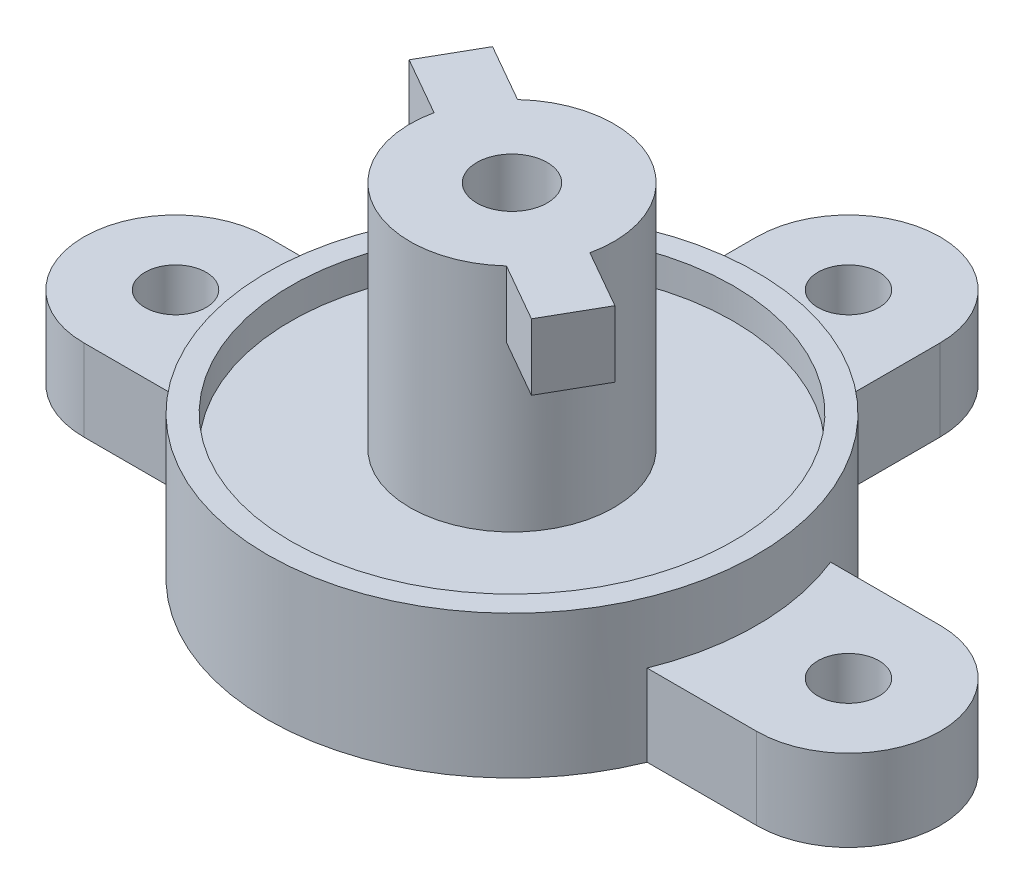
ISO-10303-21;
HEADER;
FILE_DESCRIPTION(('STEP AP214'),'2;1');
FILE_NAME('part.step','',(''),(''),'','','');
FILE_SCHEMA(('AUTOMOTIVE_DESIGN { 1 0 10303 214 1 1 1 1 }'));
ENDSEC;
DATA;
#1=APPLICATION_CONTEXT('core data for automotive mechanical design processes');
#2=APPLICATION_PROTOCOL_DEFINITION('international standard','automotive_design',2000,#1);
#3=PRODUCT_CONTEXT('',#1,'mechanical');
#4=PRODUCT('Part','Part','',(#3));
#5=PRODUCT_RELATED_PRODUCT_CATEGORY('part','',(#4));
#6=PRODUCT_DEFINITION_FORMATION('','',#4);
#7=PRODUCT_DEFINITION_CONTEXT('part definition',#1,'design');
#8=PRODUCT_DEFINITION('design','',#6,#7);
#9=PRODUCT_DEFINITION_SHAPE('','',#8);
#10=(LENGTH_UNIT() NAMED_UNIT(*) SI_UNIT(.MILLI.,.METRE.));
#11=(NAMED_UNIT(*) PLANE_ANGLE_UNIT() SI_UNIT($,.RADIAN.));
#12=(NAMED_UNIT(*) SI_UNIT($,.STERADIAN.) SOLID_ANGLE_UNIT());
#13=UNCERTAINTY_MEASURE_WITH_UNIT(LENGTH_MEASURE(1.E-05),#10,'distance_accuracy_value','');
#14=(GEOMETRIC_REPRESENTATION_CONTEXT(3) GLOBAL_UNCERTAINTY_ASSIGNED_CONTEXT((#13)) GLOBAL_UNIT_ASSIGNED_CONTEXT((#10,
#11,#12)) REPRESENTATION_CONTEXT('',''));
#15=CARTESIAN_POINT('',(0.,0.,0.));
#16=DIRECTION('',(0.,0.,1.));
#17=DIRECTION('',(1.,0.,0.));
#18=AXIS2_PLACEMENT_3D('',#15,#16,#17);
#19=CARTESIAN_POINT('',(68.25,-2.,-50.1242977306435));
#20=DIRECTION('',(0.,1.,0.));
#21=DIRECTION('',(0.,0.,1.));
#22=AXIS2_PLACEMENT_3D('',#19,#20,#21);
#23=PLANE('',#22);
#24=CARTESIAN_POINT('',(47.25,-2.,-39.));
#25=DIRECTION('',(0.,1.,0.));
#26=DIRECTION('',(0.,0.,1.));
#27=AXIS2_PLACEMENT_3D('',#24,#25,#26);
#28=CIRCLE('',#27,1.5);
#29=CARTESIAN_POINT('',(47.25,-2.,-37.5));
#30=VERTEX_POINT('',#29);
#31=EDGE_CURVE('E433',#30,#30,#28,.F.);
#32=ORIENTED_EDGE('',*,*,#31,.F.);
#33=EDGE_LOOP('',(#32));
#34=FACE_BOUND('',#33,.T.);
#35=CARTESIAN_POINT('',(80.25,-2.,-39.));
#36=DIRECTION('',(0.,1.,0.));
#37=DIRECTION('',(0.,0.,1.));
#38=AXIS2_PLACEMENT_3D('',#35,#36,#37);
#39=CIRCLE('',#38,1.50000000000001);
#40=CARTESIAN_POINT('',(80.25,-2.,-37.5));
#41=VERTEX_POINT('',#40);
#42=EDGE_CURVE('E103',#41,#41,#39,.T.);
#43=ORIENTED_EDGE('',*,*,#42,.T.);
#44=EDGE_LOOP('',(#43));
#45=FACE_BOUND('',#44,.T.);
#46=DIRECTION('',(1.,0.,0.));
#47=VECTOR('',#46,1.);
#48=CARTESIAN_POINT('',(0.,-2.,-43.5));
#49=LINE('',#48,#47);
#50=CARTESIAN_POINT('',(47.25,-2.,-43.5));
#51=VERTEX_POINT('',#50);
#52=CARTESIAN_POINT('',(52.6257022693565,-2.,-43.5));
#53=VERTEX_POINT('',#52);
#54=EDGE_CURVE('E107',#51,#53,#49,.T.);
#55=ORIENTED_EDGE('',*,*,#54,.T.);
#56=CARTESIAN_POINT('',(63.75,-2.,-39.));
#57=DIRECTION('',(0.,1.,0.));
#58=DIRECTION('',(0.,0.,1.));
#59=AXIS2_PLACEMENT_3D('',#56,#57,#58);
#60=CIRCLE('',#59,12.);
#61=CARTESIAN_POINT('',(59.25,-2.,-50.1242977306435));
#62=VERTEX_POINT('',#61);
#63=EDGE_CURVE('E145',#62,#53,#60,.T.);
#64=ORIENTED_EDGE('',*,*,#63,.F.);
#65=DIRECTION('',(0.,0.,1.));
#66=VECTOR('',#65,1.);
#67=CARTESIAN_POINT('',(59.25,-2.,0.));
#68=LINE('',#67,#66);
#69=CARTESIAN_POINT('',(59.25,-2.,-55.5));
#70=VERTEX_POINT('',#69);
#71=EDGE_CURVE('E50',#70,#62,#68,.T.);
#72=ORIENTED_EDGE('',*,*,#71,.F.);
#73=CARTESIAN_POINT('',(63.75,-2.,-55.5));
#74=DIRECTION('',(0.,1.,0.));
#75=DIRECTION('',(0.,0.,1.));
#76=AXIS2_PLACEMENT_3D('',#73,#74,#75);
#77=CIRCLE('',#76,4.49999999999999);
#78=CARTESIAN_POINT('',(68.25,-2.,-55.5));
#79=VERTEX_POINT('',#78);
#80=EDGE_CURVE('E11',#79,#70,#77,.T.);
#81=ORIENTED_EDGE('',*,*,#80,.F.);
#82=DIRECTION('',(0.,0.,1.));
#83=VECTOR('',#82,1.);
#84=CARTESIAN_POINT('',(68.25,-2.,0.));
#85=LINE('',#84,#83);
#86=CARTESIAN_POINT('',(68.25,-2.,-50.1242977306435));
#87=VERTEX_POINT('',#86);
#88=EDGE_CURVE('E44',#79,#87,#85,.T.);
#89=ORIENTED_EDGE('',*,*,#88,.T.);
#90=CARTESIAN_POINT('',(74.8742977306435,-2.,-43.5));
#91=VERTEX_POINT('',#90);
#92=EDGE_CURVE('E123',#91,#87,#60,.T.);
#93=ORIENTED_EDGE('',*,*,#92,.F.);
#94=DIRECTION('',(-1.,0.,0.));
#95=VECTOR('',#94,1.);
#96=CARTESIAN_POINT('',(0.,-2.,-43.5));
#97=LINE('',#96,#95);
#98=CARTESIAN_POINT('',(80.25,-2.,-43.5));
#99=VERTEX_POINT('',#98);
#100=EDGE_CURVE('E282',#99,#91,#97,.T.);
#101=ORIENTED_EDGE('',*,*,#100,.F.);
#102=CARTESIAN_POINT('',(80.25,-2.,-39.));
#103=DIRECTION('',(0.,1.,0.));
#104=DIRECTION('',(0.,0.,1.));
#105=AXIS2_PLACEMENT_3D('',#102,#103,#104);
#106=CIRCLE('',#105,4.49999999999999);
#107=CARTESIAN_POINT('',(80.25,-2.,-34.5));
#108=VERTEX_POINT('',#107);
#109=EDGE_CURVE('E88',#108,#99,#106,.T.);
#110=ORIENTED_EDGE('',*,*,#109,.F.);
#111=DIRECTION('',(-1.,0.,0.));
#112=VECTOR('',#111,1.);
#113=CARTESIAN_POINT('',(0.,-2.,-34.4999999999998));
#114=LINE('',#113,#112);
#115=CARTESIAN_POINT('',(74.8742977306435,-2.,-34.5));
#116=VERTEX_POINT('',#115);
#117=EDGE_CURVE('E109',#108,#116,#114,.T.);
#118=ORIENTED_EDGE('',*,*,#117,.T.);
#119=CARTESIAN_POINT('',(52.6257022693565,-2.,-34.5));
#120=VERTEX_POINT('',#119);
#121=EDGE_CURVE('E150',#120,#116,#60,.T.);
#122=ORIENTED_EDGE('',*,*,#121,.F.);
#123=DIRECTION('',(1.,0.,0.));
#124=VECTOR('',#123,1.);
#125=CARTESIAN_POINT('',(0.,-2.,-34.5));
#126=LINE('',#125,#124);
#127=CARTESIAN_POINT('',(47.25,-2.,-34.5));
#128=VERTEX_POINT('',#127);
#129=EDGE_CURVE('E251',#128,#120,#126,.T.);
#130=ORIENTED_EDGE('',*,*,#129,.F.);
#131=CARTESIAN_POINT('',(47.25,-2.,-39.));
#132=DIRECTION('',(0.,1.,0.));
#133=DIRECTION('',(0.,0.,1.));
#134=AXIS2_PLACEMENT_3D('',#131,#132,#133);
#135=CIRCLE('',#134,4.5);
#136=EDGE_CURVE('E254',#51,#128,#135,.T.);
#137=ORIENTED_EDGE('',*,*,#136,.F.);
#138=EDGE_LOOP('',(#55,#64,#72,#81,#89,#93,#101,#110,#118,#122,#130,#137));
#139=FACE_BOUND('',#138,.T.);
#140=CARTESIAN_POINT('',(63.75,-2.,-55.5));
#141=DIRECTION('',(0.,1.,0.));
#142=DIRECTION('',(0.,0.,1.));
#143=AXIS2_PLACEMENT_3D('',#140,#141,#142);
#144=CIRCLE('',#143,1.5);
#145=CARTESIAN_POINT('',(63.75,-2.,-54.));
#146=VERTEX_POINT('',#145);
#147=EDGE_CURVE('E432',#146,#146,#144,.F.);
#148=ORIENTED_EDGE('',*,*,#147,.F.);
#149=EDGE_LOOP('',(#148));
#150=FACE_BOUND('',#149,.T.);
#151=CARTESIAN_POINT('',(63.75,-2.,-39.));
#152=DIRECTION('',(0.,1.,0.));
#153=DIRECTION('',(0.,0.,1.));
#154=AXIS2_PLACEMENT_3D('',#151,#152,#153);
#155=CIRCLE('',#154,1.725);
#156=CARTESIAN_POINT('',(63.75,-2.,-37.275));
#157=VERTEX_POINT('',#156);
#158=EDGE_CURVE('E106',#157,#157,#155,.F.);
#159=ORIENTED_EDGE('',*,*,#158,.F.);
#160=EDGE_LOOP('',(#159));
#161=FACE_BOUND('',#160,.T.);
#162=ADVANCED_FACE('F41',(#34,#45,#139,#150,#161),#23,.F.);
#163=CARTESIAN_POINT('',(0.,11.55,0.));
#164=DIRECTION('',(0.,1.,0.));
#165=DIRECTION('',(0.,0.,1.));
#166=AXIS2_PLACEMENT_3D('',#163,#164,#165);
#167=PLANE('',#166);
#168=CARTESIAN_POINT('',(63.75,11.55,-39.));
#169=DIRECTION('',(0.,1.,0.));
#170=DIRECTION('',(0.,0.,1.));
#171=AXIS2_PLACEMENT_3D('',#168,#169,#170);
#172=CIRCLE('',#171,5.00000000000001);
#173=CARTESIAN_POINT('',(60.3529525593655,11.55,-42.6687966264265));
#174=VERTEX_POINT('',#173);
#175=CARTESIAN_POINT('',(58.864535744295,11.55,-40.0640672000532));
#176=VERTEX_POINT('',#175);
#177=EDGE_CURVE('E190',#174,#176,#172,.T.);
#178=ORIENTED_EDGE('',*,*,#177,.T.);
#179=DIRECTION('',(-0.868243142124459,0.,-0.496138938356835));
#180=VECTOR('',#179,1.);
#181=CARTESIAN_POINT('',(31.7480992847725,11.55,-55.5591737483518));
#182=LINE('',#181,#180);
#183=CARTESIAN_POINT('',(56.0057915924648,11.55,-41.6976352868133));
#184=VERTEX_POINT('',#183);
#185=EDGE_CURVE('E177',#176,#184,#182,.T.);
#186=ORIENTED_EDGE('',*,*,#185,.T.);
#187=DIRECTION('',(0.496138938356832,0.,-0.86824314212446));
#188=VECTOR('',#187,1.);
#189=CARTESIAN_POINT('',(24.2576923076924,11.55,13.8615384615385));
#190=LINE('',#189,#188);
#191=CARTESIAN_POINT('',(57.4942084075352,11.55,-44.3023647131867));
#192=VERTEX_POINT('',#191);
#193=EDGE_CURVE('E199',#184,#192,#190,.T.);
#194=ORIENTED_EDGE('',*,*,#193,.T.);
#195=DIRECTION('',(-0.86824314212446,0.,-0.496138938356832));
#196=VECTOR('',#195,1.);
#197=CARTESIAN_POINT('',(33.2365160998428,11.55,-58.1639031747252));
#198=LINE('',#197,#196);
#199=EDGE_CURVE('E202',#174,#192,#198,.T.);
#200=ORIENTED_EDGE('',*,*,#199,.F.);
#201=EDGE_LOOP('',(#178,#186,#194,#200));
#202=FACE_BOUND('',#201,.T.);
#203=ADVANCED_FACE('F324',(#202),#167,.F.);
#204=CARTESIAN_POINT('',(0.,11.55,0.));
#205=DIRECTION('',(0.,1.,0.));
#206=DIRECTION('',(0.,0.,1.));
#207=AXIS2_PLACEMENT_3D('',#204,#205,#206);
#208=PLANE('',#207);
#209=CARTESIAN_POINT('',(63.75,11.55,-39.));
#210=DIRECTION('',(0.,1.,0.));
#211=DIRECTION('',(0.,0.,1.));
#212=AXIS2_PLACEMENT_3D('',#209,#210,#211);
#213=CIRCLE('',#212,5.00000000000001);
#214=CARTESIAN_POINT('',(67.1470474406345,11.55,-35.3312033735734));
#215=VERTEX_POINT('',#214);
#216=CARTESIAN_POINT('',(68.635464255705,11.55,-37.9359327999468));
#217=VERTEX_POINT('',#216);
#218=EDGE_CURVE('E223',#215,#217,#213,.T.);
#219=ORIENTED_EDGE('',*,*,#218,.T.);
#220=DIRECTION('',(0.868243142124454,0.,0.496138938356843));
#221=VECTOR('',#220,1.);
#222=CARTESIAN_POINT('',(33.2365160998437,11.55,-58.1639031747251));
#223=LINE('',#222,#221);
#224=CARTESIAN_POINT('',(71.4942084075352,11.55,-36.3023647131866));
#225=VERTEX_POINT('',#224);
#226=EDGE_CURVE('E210',#217,#225,#223,.T.);
#227=ORIENTED_EDGE('',*,*,#226,.T.);
#228=DIRECTION('',(-0.496138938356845,0.,0.868243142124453));
#229=VECTOR('',#228,1.);
#230=CARTESIAN_POINT('',(38.2576923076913,11.55,21.8615384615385));
#231=LINE('',#230,#229);
#232=CARTESIAN_POINT('',(70.0057915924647,11.55,-33.6976352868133));
#233=VERTEX_POINT('',#232);
#234=EDGE_CURVE('E232',#225,#233,#231,.T.);
#235=ORIENTED_EDGE('',*,*,#234,.T.);
#236=DIRECTION('',(0.868243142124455,0.,0.496138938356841));
#237=VECTOR('',#236,1.);
#238=CARTESIAN_POINT('',(31.7480992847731,11.55,-55.5591737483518));
#239=LINE('',#238,#237);
#240=EDGE_CURVE('E235',#215,#233,#239,.T.);
#241=ORIENTED_EDGE('',*,*,#240,.F.);
#242=EDGE_LOOP('',(#219,#227,#235,#241));
#243=FACE_BOUND('',#242,.T.);
#244=ADVANCED_FACE('F330',(#243),#208,.F.);
#245=CARTESIAN_POINT('',(0.,3.5,0.));
#246=DIRECTION('',(0.,1.,0.));
#247=DIRECTION('',(0.,0.,1.));
#248=AXIS2_PLACEMENT_3D('',#245,#246,#247);
#249=PLANE('',#248);
#250=CARTESIAN_POINT('',(63.75,3.5,-39.));
#251=DIRECTION('',(0.,1.,0.));
#252=DIRECTION('',(0.,0.,1.));
#253=AXIS2_PLACEMENT_3D('',#250,#251,#252);
#254=CIRCLE('',#253,5.00000000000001);
#255=CARTESIAN_POINT('',(63.75,3.5,-34.));
#256=VERTEX_POINT('',#255);
#257=EDGE_CURVE('E164',#256,#256,#254,.T.);
#258=ORIENTED_EDGE('',*,*,#257,.F.);
#259=EDGE_LOOP('',(#258));
#260=FACE_BOUND('',#259,.T.);
#261=CARTESIAN_POINT('',(63.75,3.5,-39.));
#262=DIRECTION('',(0.,1.,0.));
#263=DIRECTION('',(0.,0.,1.));
#264=AXIS2_PLACEMENT_3D('',#261,#262,#263);
#265=CIRCLE('',#264,10.85);
#266=CARTESIAN_POINT('',(63.75,3.5,-28.15));
#267=VERTEX_POINT('',#266);
#268=EDGE_CURVE('E154',#267,#267,#265,.F.);
#269=ORIENTED_EDGE('',*,*,#268,.F.);
#270=EDGE_LOOP('',(#269));
#271=FACE_BOUND('',#270,.T.);
#272=ADVANCED_FACE('F350',(#260,#271),#249,.T.);
#273=CARTESIAN_POINT('',(63.75,5.,-39.));
#274=DIRECTION('',(0.,-1.,0.));
#275=DIRECTION('',(0.,0.,-1.));
#276=AXIS2_PLACEMENT_3D('',#273,#274,#275);
#277=CYLINDRICAL_SURFACE('',#276,10.85);
#278=CARTESIAN_POINT('',(63.75,5.,-39.));
#279=DIRECTION('',(0.,1.,0.));
#280=DIRECTION('',(0.,0.,1.));
#281=AXIS2_PLACEMENT_3D('',#278,#279,#280);
#282=CIRCLE('',#281,10.85);
#283=CARTESIAN_POINT('',(63.75,5.,-28.15));
#284=VERTEX_POINT('',#283);
#285=EDGE_CURVE('E160',#284,#284,#282,.T.);
#286=ORIENTED_EDGE('',*,*,#285,.T.);
#287=EDGE_LOOP('',(#286));
#288=FACE_BOUND('',#287,.T.);
#289=ORIENTED_EDGE('',*,*,#268,.T.);
#290=EDGE_LOOP('',(#289));
#291=FACE_BOUND('',#290,.T.);
#292=ADVANCED_FACE('F353',(#288,#291),#277,.F.);
#293=CARTESIAN_POINT('',(0.,5.,0.));
#294=DIRECTION('',(0.,1.,0.));
#295=DIRECTION('',(0.,0.,1.));
#296=AXIS2_PLACEMENT_3D('',#293,#294,#295);
#297=PLANE('',#296);
#298=ORIENTED_EDGE('',*,*,#285,.F.);
#299=EDGE_LOOP('',(#298));
#300=FACE_BOUND('',#299,.T.);
#301=CARTESIAN_POINT('',(63.75,5.,-39.));
#302=DIRECTION('',(0.,1.,0.));
#303=DIRECTION('',(0.,0.,1.));
#304=AXIS2_PLACEMENT_3D('',#301,#302,#303);
#305=CIRCLE('',#304,12.);
#306=CARTESIAN_POINT('',(63.75,5.,-27.));
#307=VERTEX_POINT('',#306);
#308=EDGE_CURVE('E153',#307,#307,#305,.T.);
#309=ORIENTED_EDGE('',*,*,#308,.T.);
#310=EDGE_LOOP('',(#309));
#311=FACE_BOUND('',#310,.T.);
#312=ADVANCED_FACE('F357',(#300,#311),#297,.T.);
#313=CARTESIAN_POINT('',(0.,2.,-43.5));
#314=DIRECTION('',(0.,0.,-1.));
#315=DIRECTION('',(-1.,0.,0.));
#316=AXIS2_PLACEMENT_3D('',#313,#314,#315);
#317=PLANE('',#316);
#318=ORIENTED_EDGE('',*,*,#54,.F.);
#319=DIRECTION('',(0.,-1.,0.));
#320=VECTOR('',#319,1.);
#321=CARTESIAN_POINT('',(47.25,2.,-43.5));
#322=LINE('',#321,#320);
#323=CARTESIAN_POINT('',(47.25,2.,-43.5));
#324=VERTEX_POINT('',#323);
#325=EDGE_CURVE('E229',#324,#51,#322,.T.);
#326=ORIENTED_EDGE('',*,*,#325,.F.);
#327=DIRECTION('',(1.,0.,0.));
#328=VECTOR('',#327,1.);
#329=CARTESIAN_POINT('',(0.,2.,-43.5));
#330=LINE('',#329,#328);
#331=CARTESIAN_POINT('',(52.6257022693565,2.,-43.5));
#332=VERTEX_POINT('',#331);
#333=EDGE_CURVE('E267',#324,#332,#330,.T.);
#334=ORIENTED_EDGE('',*,*,#333,.T.);
#335=DIRECTION('',(0.,-1.,0.));
#336=VECTOR('',#335,1.);
#337=CARTESIAN_POINT('',(52.6257022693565,2.,-43.5));
#338=LINE('',#337,#336);
#339=EDGE_CURVE('E248',#332,#53,#338,.T.);
#340=ORIENTED_EDGE('',*,*,#339,.T.);
#341=EDGE_LOOP('',(#318,#326,#334,#340));
#342=FACE_BOUND('',#341,.T.);
#343=ADVANCED_FACE('F361',(#342),#317,.T.);
#344=CARTESIAN_POINT('',(47.25,2.,-39.));
#345=DIRECTION('',(0.,-1.,0.));
#346=DIRECTION('',(0.,0.,-1.));
#347=AXIS2_PLACEMENT_3D('',#344,#345,#346);
#348=CYLINDRICAL_SURFACE('',#347,4.5);
#349=ORIENTED_EDGE('',*,*,#136,.T.);
#350=DIRECTION('',(0.,-1.,0.));
#351=VECTOR('',#350,1.);
#352=CARTESIAN_POINT('',(47.25,2.,-34.5));
#353=LINE('',#352,#351);
#354=CARTESIAN_POINT('',(47.25,2.,-34.5));
#355=VERTEX_POINT('',#354);
#356=EDGE_CURVE('E242',#355,#128,#353,.T.);
#357=ORIENTED_EDGE('',*,*,#356,.F.);
#358=CARTESIAN_POINT('',(47.25,2.,-39.));
#359=DIRECTION('',(0.,1.,0.));
#360=DIRECTION('',(0.,0.,1.));
#361=AXIS2_PLACEMENT_3D('',#358,#359,#360);
#362=CIRCLE('',#361,4.5);
#363=EDGE_CURVE('E264',#324,#355,#362,.T.);
#364=ORIENTED_EDGE('',*,*,#363,.F.);
#365=ORIENTED_EDGE('',*,*,#325,.T.);
#366=EDGE_LOOP('',(#349,#357,#364,#365));
#367=FACE_BOUND('',#366,.T.);
#368=ADVANCED_FACE('F394',(#367),#348,.T.);
#369=CARTESIAN_POINT('',(0.,2.,0.));
#370=DIRECTION('',(0.,1.,0.));
#371=DIRECTION('',(0.,0.,1.));
#372=AXIS2_PLACEMENT_3D('',#369,#370,#371);
#373=PLANE('',#372);
#374=CARTESIAN_POINT('',(47.25,2.,-39.));
#375=DIRECTION('',(0.,1.,0.));
#376=DIRECTION('',(0.,0.,1.));
#377=AXIS2_PLACEMENT_3D('',#374,#375,#376);
#378=CIRCLE('',#377,1.5);
#379=CARTESIAN_POINT('',(47.25,2.,-37.5));
#380=VERTEX_POINT('',#379);
#381=EDGE_CURVE('E255',#380,#380,#378,.F.);
#382=ORIENTED_EDGE('',*,*,#381,.T.);
#383=EDGE_LOOP('',(#382));
#384=FACE_BOUND('',#383,.T.);
#385=ORIENTED_EDGE('',*,*,#333,.F.);
#386=ORIENTED_EDGE('',*,*,#363,.T.);
#387=DIRECTION('',(1.,0.,0.));
#388=VECTOR('',#387,1.);
#389=CARTESIAN_POINT('',(0.,2.,-34.5));
#390=LINE('',#389,#388);
#391=CARTESIAN_POINT('',(52.6257022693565,2.,-34.5));
#392=VERTEX_POINT('',#391);
#393=EDGE_CURVE('E261',#355,#392,#390,.T.);
#394=ORIENTED_EDGE('',*,*,#393,.T.);
#395=CARTESIAN_POINT('',(63.75,2.,-39.));
#396=DIRECTION('',(0.,1.,0.));
#397=DIRECTION('',(0.,0.,1.));
#398=AXIS2_PLACEMENT_3D('',#395,#396,#397);
#399=CIRCLE('',#398,12.);
#400=EDGE_CURVE('E250',#392,#332,#399,.F.);
#401=ORIENTED_EDGE('',*,*,#400,.T.);
#402=EDGE_LOOP('',(#385,#386,#394,#401));
#403=FACE_BOUND('',#402,.T.);
#404=ADVANCED_FACE('F397',(#384,#403),#373,.T.);
#405=CARTESIAN_POINT('',(0.,2.,-34.4999999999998));
#406=DIRECTION('',(0.,0.,1.));
#407=DIRECTION('',(1.,0.,0.));
#408=AXIS2_PLACEMENT_3D('',#405,#406,#407);
#409=PLANE('',#408);
#410=ORIENTED_EDGE('',*,*,#117,.F.);
#411=DIRECTION('',(0.,-1.,0.));
#412=VECTOR('',#411,1.);
#413=CARTESIAN_POINT('',(80.25,2.,-34.5));
#414=LINE('',#413,#412);
#415=CARTESIAN_POINT('',(80.25,2.,-34.5));
#416=VERTEX_POINT('',#415);
#417=EDGE_CURVE('E258',#416,#108,#414,.T.);
#418=ORIENTED_EDGE('',*,*,#417,.F.);
#419=DIRECTION('',(-1.,0.,0.));
#420=VECTOR('',#419,1.);
#421=CARTESIAN_POINT('',(0.,2.,-34.4999999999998));
#422=LINE('',#421,#420);
#423=CARTESIAN_POINT('',(74.8742977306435,2.,-34.5));
#424=VERTEX_POINT('',#423);
#425=EDGE_CURVE('E296',#416,#424,#422,.T.);
#426=ORIENTED_EDGE('',*,*,#425,.T.);
#427=DIRECTION('',(0.,-1.,0.));
#428=VECTOR('',#427,1.);
#429=CARTESIAN_POINT('',(74.8742977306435,2.,-34.5));
#430=LINE('',#429,#428);
#431=EDGE_CURVE('E279',#424,#116,#430,.T.);
#432=ORIENTED_EDGE('',*,*,#431,.T.);
#433=EDGE_LOOP('',(#410,#418,#426,#432));
#434=FACE_BOUND('',#433,.T.);
#435=ADVANCED_FACE('F402',(#434),#409,.T.);
#436=CARTESIAN_POINT('',(80.25,2.,-39.));
#437=DIRECTION('',(0.,-1.,0.));
#438=DIRECTION('',(0.,0.,-1.));
#439=AXIS2_PLACEMENT_3D('',#436,#437,#438);
#440=CYLINDRICAL_SURFACE('',#439,4.49999999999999);
#441=ORIENTED_EDGE('',*,*,#109,.T.);
#442=DIRECTION('',(0.,-1.,0.));
#443=VECTOR('',#442,1.);
#444=CARTESIAN_POINT('',(80.25,2.,-43.5));
#445=LINE('',#444,#443);
#446=CARTESIAN_POINT('',(80.25,2.,-43.5));
#447=VERTEX_POINT('',#446);
#448=EDGE_CURVE('E274',#447,#99,#445,.T.);
#449=ORIENTED_EDGE('',*,*,#448,.F.);
#450=CARTESIAN_POINT('',(80.25,2.,-39.));
#451=DIRECTION('',(0.,1.,0.));
#452=DIRECTION('',(0.,0.,1.));
#453=AXIS2_PLACEMENT_3D('',#450,#451,#452);
#454=CIRCLE('',#453,4.49999999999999);
#455=EDGE_CURVE('E293',#416,#447,#454,.T.);
#456=ORIENTED_EDGE('',*,*,#455,.F.);
#457=ORIENTED_EDGE('',*,*,#417,.T.);
#458=EDGE_LOOP('',(#441,#449,#456,#457));
#459=FACE_BOUND('',#458,.T.);
#460=ADVANCED_FACE('F406',(#459),#440,.T.);
#461=CARTESIAN_POINT('',(0.,2.,0.));
#462=DIRECTION('',(0.,1.,0.));
#463=DIRECTION('',(0.,0.,1.));
#464=AXIS2_PLACEMENT_3D('',#461,#462,#463);
#465=PLANE('',#464);
#466=CARTESIAN_POINT('',(80.25,2.,-39.));
#467=DIRECTION('',(0.,1.,0.));
#468=DIRECTION('',(0.,0.,1.));
#469=AXIS2_PLACEMENT_3D('',#466,#467,#468);
#470=CIRCLE('',#469,1.50000000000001);
#471=CARTESIAN_POINT('',(80.25,2.,-37.5));
#472=VERTEX_POINT('',#471);
#473=EDGE_CURVE('E285',#472,#472,#470,.F.);
#474=ORIENTED_EDGE('',*,*,#473,.T.);
#475=EDGE_LOOP('',(#474));
#476=FACE_BOUND('',#475,.T.);
#477=ORIENTED_EDGE('',*,*,#425,.F.);
#478=ORIENTED_EDGE('',*,*,#455,.T.);
#479=DIRECTION('',(-1.,0.,0.));
#480=VECTOR('',#479,1.);
#481=CARTESIAN_POINT('',(0.,2.,-43.5));
#482=LINE('',#481,#480);
#483=CARTESIAN_POINT('',(74.8742977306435,2.,-43.5));
#484=VERTEX_POINT('',#483);
#485=EDGE_CURVE('E290',#447,#484,#482,.T.);
#486=ORIENTED_EDGE('',*,*,#485,.T.);
#487=CARTESIAN_POINT('',(63.75,2.,-39.));
#488=DIRECTION('',(0.,1.,0.));
#489=DIRECTION('',(0.,0.,1.));
#490=AXIS2_PLACEMENT_3D('',#487,#488,#489);
#491=CIRCLE('',#490,12.);
#492=EDGE_CURVE('E281',#484,#424,#491,.F.);
#493=ORIENTED_EDGE('',*,*,#492,.T.);
#494=EDGE_LOOP('',(#477,#478,#486,#493));
#495=FACE_BOUND('',#494,.T.);
#496=ADVANCED_FACE('F302',(#476,#495),#465,.T.);
#497=CARTESIAN_POINT('',(68.25,2.,0.));
#498=DIRECTION('',(1.,0.,0.));
#499=DIRECTION('',(0.,0.,-1.));
#500=AXIS2_PLACEMENT_3D('',#497,#498,#499);
#501=PLANE('',#500);
#502=ORIENTED_EDGE('',*,*,#88,.F.);
#503=DIRECTION('',(0.,-1.,0.));
#504=VECTOR('',#503,1.);
#505=CARTESIAN_POINT('',(68.25,2.,-55.5));
#506=LINE('',#505,#504);
#507=CARTESIAN_POINT('',(68.25,2.,-55.5));
#508=VERTEX_POINT('',#507);
#509=EDGE_CURVE('E78',#508,#79,#506,.T.);
#510=ORIENTED_EDGE('',*,*,#509,.F.);
#511=DIRECTION('',(0.,0.,1.));
#512=VECTOR('',#511,1.);
#513=CARTESIAN_POINT('',(68.25,2.,0.));
#514=LINE('',#513,#512);
#515=CARTESIAN_POINT('',(68.25,2.,-50.1242977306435));
#516=VERTEX_POINT('',#515);
#517=EDGE_CURVE('E83',#508,#516,#514,.T.);
#518=ORIENTED_EDGE('',*,*,#517,.T.);
#519=DIRECTION('',(0.,-1.,0.));
#520=VECTOR('',#519,1.);
#521=CARTESIAN_POINT('',(68.25,2.,-50.1242977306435));
#522=LINE('',#521,#520);
#523=EDGE_CURVE('E127',#516,#87,#522,.T.);
#524=ORIENTED_EDGE('',*,*,#523,.T.);
#525=EDGE_LOOP('',(#502,#510,#518,#524));
#526=FACE_BOUND('',#525,.T.);
#527=ADVANCED_FACE('F80',(#526),#501,.T.);
#528=CARTESIAN_POINT('',(63.75,2.,-55.5));
#529=DIRECTION('',(0.,-1.,0.));
#530=DIRECTION('',(0.,0.,-1.));
#531=AXIS2_PLACEMENT_3D('',#528,#529,#530);
#532=CYLINDRICAL_SURFACE('',#531,4.49999999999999);
#533=ORIENTED_EDGE('',*,*,#80,.T.);
#534=DIRECTION('',(0.,-1.,0.));
#535=VECTOR('',#534,1.);
#536=CARTESIAN_POINT('',(59.25,2.,-55.5));
#537=LINE('',#536,#535);
#538=CARTESIAN_POINT('',(59.25,2.,-55.5));
#539=VERTEX_POINT('',#538);
#540=EDGE_CURVE('E87',#539,#70,#537,.T.);
#541=ORIENTED_EDGE('',*,*,#540,.F.);
#542=CARTESIAN_POINT('',(63.75,2.,-55.5));
#543=DIRECTION('',(0.,1.,0.));
#544=DIRECTION('',(0.,0.,1.));
#545=AXIS2_PLACEMENT_3D('',#542,#543,#544);
#546=CIRCLE('',#545,4.49999999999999);
#547=EDGE_CURVE('E90',#508,#539,#546,.T.);
#548=ORIENTED_EDGE('',*,*,#547,.F.);
#549=ORIENTED_EDGE('',*,*,#509,.T.);
#550=EDGE_LOOP('',(#533,#541,#548,#549));
#551=FACE_BOUND('',#550,.T.);
#552=ADVANCED_FACE('F91',(#551),#532,.T.);
#553=CARTESIAN_POINT('',(0.,2.,0.));
#554=DIRECTION('',(0.,1.,0.));
#555=DIRECTION('',(0.,0.,1.));
#556=AXIS2_PLACEMENT_3D('',#553,#554,#555);
#557=PLANE('',#556);
#558=CARTESIAN_POINT('',(63.75,2.,-55.5));
#559=DIRECTION('',(0.,1.,0.));
#560=DIRECTION('',(0.,0.,1.));
#561=AXIS2_PLACEMENT_3D('',#558,#559,#560);
#562=CIRCLE('',#561,1.5);
#563=CARTESIAN_POINT('',(63.75,2.,-54.));
#564=VERTEX_POINT('',#563);
#565=EDGE_CURVE('E97',#564,#564,#562,.T.);
#566=ORIENTED_EDGE('',*,*,#565,.F.);
#567=EDGE_LOOP('',(#566));
#568=FACE_BOUND('',#567,.T.);
#569=ORIENTED_EDGE('',*,*,#517,.F.);
#570=ORIENTED_EDGE('',*,*,#547,.T.);
#571=DIRECTION('',(0.,0.,1.));
#572=VECTOR('',#571,1.);
#573=CARTESIAN_POINT('',(59.25,2.,0.));
#574=LINE('',#573,#572);
#575=CARTESIAN_POINT('',(59.25,2.,-50.1242977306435));
#576=VERTEX_POINT('',#575);
#577=EDGE_CURVE('E72',#539,#576,#574,.T.);
#578=ORIENTED_EDGE('',*,*,#577,.T.);
#579=CARTESIAN_POINT('',(63.75,2.,-39.));
#580=DIRECTION('',(0.,1.,0.));
#581=DIRECTION('',(0.,0.,1.));
#582=AXIS2_PLACEMENT_3D('',#579,#580,#581);
#583=CIRCLE('',#582,12.);
#584=EDGE_CURVE('E96',#576,#516,#583,.F.);
#585=ORIENTED_EDGE('',*,*,#584,.T.);
#586=EDGE_LOOP('',(#569,#570,#578,#585));
#587=FACE_BOUND('',#586,.T.);
#588=ADVANCED_FACE('F94',(#568,#587),#557,.T.);
#589=CARTESIAN_POINT('',(63.75,2.,-55.5));
#590=DIRECTION('',(0.,-1.,0.));
#591=DIRECTION('',(0.,0.,-1.));
#592=AXIS2_PLACEMENT_3D('',#589,#590,#591);
#593=CYLINDRICAL_SURFACE('',#592,1.5);
#594=ORIENTED_EDGE('',*,*,#565,.T.);
#595=EDGE_LOOP('',(#594));
#596=FACE_BOUND('',#595,.T.);
#597=ORIENTED_EDGE('',*,*,#147,.T.);
#598=EDGE_LOOP('',(#597));
#599=FACE_BOUND('',#598,.T.);
#600=ADVANCED_FACE('F349',(#596,#599),#593,.F.);
#601=CARTESIAN_POINT('',(63.75,3.5,-39.));
#602=DIRECTION('',(0.,-1.,0.));
#603=DIRECTION('',(0.,0.,-1.));
#604=AXIS2_PLACEMENT_3D('',#601,#602,#603);
#605=CYLINDRICAL_SURFACE('',#604,12.);
#606=ORIENTED_EDGE('',*,*,#92,.T.);
#607=ORIENTED_EDGE('',*,*,#523,.F.);
#608=ORIENTED_EDGE('',*,*,#584,.F.);
#609=DIRECTION('',(0.,-1.,0.));
#610=VECTOR('',#609,1.);
#611=CARTESIAN_POINT('',(59.25,2.,-50.1242977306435));
#612=LINE('',#611,#610);
#613=EDGE_CURVE('E129',#576,#62,#612,.T.);
#614=ORIENTED_EDGE('',*,*,#613,.T.);
#615=ORIENTED_EDGE('',*,*,#63,.T.);
#616=ORIENTED_EDGE('',*,*,#339,.F.);
#617=ORIENTED_EDGE('',*,*,#400,.F.);
#618=DIRECTION('',(0.,-1.,0.));
#619=VECTOR('',#618,1.);
#620=CARTESIAN_POINT('',(52.6257022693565,2.,-34.5));
#621=LINE('',#620,#619);
#622=EDGE_CURVE('E245',#392,#120,#621,.T.);
#623=ORIENTED_EDGE('',*,*,#622,.T.);
#624=ORIENTED_EDGE('',*,*,#121,.T.);
#625=ORIENTED_EDGE('',*,*,#431,.F.);
#626=ORIENTED_EDGE('',*,*,#492,.F.);
#627=DIRECTION('',(0.,-1.,0.));
#628=VECTOR('',#627,1.);
#629=CARTESIAN_POINT('',(74.8742977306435,2.,-43.5));
#630=LINE('',#629,#628);
#631=EDGE_CURVE('E277',#484,#91,#630,.T.);
#632=ORIENTED_EDGE('',*,*,#631,.T.);
#633=EDGE_LOOP('',(#606,#607,#608,#614,#615,#616,#617,#623,#624,#625,#626,#632));
#634=FACE_BOUND('',#633,.T.);
#635=ORIENTED_EDGE('',*,*,#308,.F.);
#636=EDGE_LOOP('',(#635));
#637=FACE_BOUND('',#636,.T.);
#638=ADVANCED_FACE('F140',(#634,#637),#605,.T.);
#639=CARTESIAN_POINT('',(59.25,2.,0.));
#640=DIRECTION('',(1.,0.,0.));
#641=DIRECTION('',(0.,0.,-1.));
#642=AXIS2_PLACEMENT_3D('',#639,#640,#641);
#643=PLANE('',#642);
#644=ORIENTED_EDGE('',*,*,#71,.T.);
#645=ORIENTED_EDGE('',*,*,#613,.F.);
#646=ORIENTED_EDGE('',*,*,#577,.F.);
#647=ORIENTED_EDGE('',*,*,#540,.T.);
#648=EDGE_LOOP('',(#644,#645,#646,#647));
#649=FACE_BOUND('',#648,.T.);
#650=ADVANCED_FACE('F146',(#649),#643,.F.);
#651=CARTESIAN_POINT('',(0.,2.,-43.5));
#652=DIRECTION('',(0.,0.,1.));
#653=DIRECTION('',(1.,0.,0.));
#654=AXIS2_PLACEMENT_3D('',#651,#652,#653);
#655=PLANE('',#654);
#656=ORIENTED_EDGE('',*,*,#100,.T.);
#657=ORIENTED_EDGE('',*,*,#631,.F.);
#658=ORIENTED_EDGE('',*,*,#485,.F.);
#659=ORIENTED_EDGE('',*,*,#448,.T.);
#660=EDGE_LOOP('',(#656,#657,#658,#659));
#661=FACE_BOUND('',#660,.T.);
#662=ADVANCED_FACE('F318',(#661),#655,.F.);
#663=CARTESIAN_POINT('',(0.,2.,-34.5));
#664=DIRECTION('',(0.,0.,-1.));
#665=DIRECTION('',(-1.,0.,0.));
#666=AXIS2_PLACEMENT_3D('',#663,#664,#665);
#667=PLANE('',#666);
#668=ORIENTED_EDGE('',*,*,#129,.T.);
#669=ORIENTED_EDGE('',*,*,#622,.F.);
#670=ORIENTED_EDGE('',*,*,#393,.F.);
#671=ORIENTED_EDGE('',*,*,#356,.T.);
#672=EDGE_LOOP('',(#668,#669,#670,#671));
#673=FACE_BOUND('',#672,.T.);
#674=ADVANCED_FACE('F308',(#673),#667,.F.);
#675=CARTESIAN_POINT('',(80.25,-7.,-39.));
#676=DIRECTION('',(0.,1.,0.));
#677=DIRECTION('',(0.,0.,1.));
#678=AXIS2_PLACEMENT_3D('',#675,#676,#677);
#679=CYLINDRICAL_SURFACE('',#678,1.50000000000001);
#680=ORIENTED_EDGE('',*,*,#42,.F.);
#681=EDGE_LOOP('',(#680));
#682=FACE_BOUND('',#681,.T.);
#683=ORIENTED_EDGE('',*,*,#473,.F.);
#684=EDGE_LOOP('',(#683));
#685=FACE_BOUND('',#684,.T.);
#686=ADVANCED_FACE('F305',(#682,#685),#679,.F.);
#687=CARTESIAN_POINT('',(47.25,-7.,-39.));
#688=DIRECTION('',(0.,1.,0.));
#689=DIRECTION('',(0.,0.,1.));
#690=AXIS2_PLACEMENT_3D('',#687,#688,#689);
#691=CYLINDRICAL_SURFACE('',#690,1.5);
#692=ORIENTED_EDGE('',*,*,#31,.T.);
#693=EDGE_LOOP('',(#692));
#694=FACE_BOUND('',#693,.T.);
#695=ORIENTED_EDGE('',*,*,#381,.F.);
#696=EDGE_LOOP('',(#695));
#697=FACE_BOUND('',#696,.T.);
#698=ADVANCED_FACE('F307',(#694,#697),#691,.F.);
#699=CARTESIAN_POINT('',(31.7480992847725,11.55,-55.5591737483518));
#700=DIRECTION('',(0.496138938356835,0.,-0.868243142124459));
#701=DIRECTION('',(-0.868243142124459,0.,-0.496138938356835));
#702=AXIS2_PLACEMENT_3D('',#699,#700,#701);
#703=PLANE('',#702);
#704=DIRECTION('',(-0.868243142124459,0.,-0.496138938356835));
#705=VECTOR('',#704,1.);
#706=CARTESIAN_POINT('',(31.7480992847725,14.8,-55.5591737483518));
#707=LINE('',#706,#705);
#708=CARTESIAN_POINT('',(58.864535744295,14.8,-40.0640672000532));
#709=VERTEX_POINT('',#708);
#710=CARTESIAN_POINT('',(56.0057915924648,14.8,-41.6976352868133));
#711=VERTEX_POINT('',#710);
#712=EDGE_CURVE('E186',#709,#711,#707,.T.);
#713=ORIENTED_EDGE('',*,*,#712,.T.);
#714=DIRECTION('',(0.,1.,0.));
#715=VECTOR('',#714,1.);
#716=CARTESIAN_POINT('',(56.0057915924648,11.55,-41.6976352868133));
#717=LINE('',#716,#715);
#718=EDGE_CURVE('E181',#184,#711,#717,.T.);
#719=ORIENTED_EDGE('',*,*,#718,.F.);
#720=ORIENTED_EDGE('',*,*,#185,.F.);
#721=DIRECTION('',(0.,1.,0.));
#722=VECTOR('',#721,1.);
#723=CARTESIAN_POINT('',(58.864535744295,11.55,-40.0640672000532));
#724=LINE('',#723,#722);
#725=EDGE_CURVE('E167',#176,#709,#724,.T.);
#726=ORIENTED_EDGE('',*,*,#725,.T.);
#727=EDGE_LOOP('',(#713,#719,#720,#726));
#728=FACE_BOUND('',#727,.T.);
#729=ADVANCED_FACE('F315',(#728),#703,.F.);
#730=CARTESIAN_POINT('',(24.2576923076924,11.55,13.8615384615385));
#731=DIRECTION('',(0.86824314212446,0.,0.496138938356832));
#732=DIRECTION('',(0.496138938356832,0.,-0.86824314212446));
#733=AXIS2_PLACEMENT_3D('',#730,#731,#732);
#734=PLANE('',#733);
#735=DIRECTION('',(0.496138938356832,0.,-0.86824314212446));
#736=VECTOR('',#735,1.);
#737=CARTESIAN_POINT('',(24.2576923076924,14.8,13.8615384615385));
#738=LINE('',#737,#736);
#739=CARTESIAN_POINT('',(57.4942084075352,14.8,-44.3023647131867));
#740=VERTEX_POINT('',#739);
#741=EDGE_CURVE('E189',#711,#740,#738,.T.);
#742=ORIENTED_EDGE('',*,*,#741,.T.);
#743=DIRECTION('',(0.,1.,0.));
#744=VECTOR('',#743,1.);
#745=CARTESIAN_POINT('',(57.4942084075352,11.55,-44.3023647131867));
#746=LINE('',#745,#744);
#747=EDGE_CURVE('E178',#192,#740,#746,.T.);
#748=ORIENTED_EDGE('',*,*,#747,.F.);
#749=ORIENTED_EDGE('',*,*,#193,.F.);
#750=ORIENTED_EDGE('',*,*,#718,.T.);
#751=EDGE_LOOP('',(#742,#748,#749,#750));
#752=FACE_BOUND('',#751,.T.);
#753=ADVANCED_FACE('F371',(#752),#734,.F.);
#754=CARTESIAN_POINT('',(33.2365160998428,11.55,-58.1639031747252));
#755=DIRECTION('',(0.496138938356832,0.,-0.86824314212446));
#756=DIRECTION('',(-0.86824314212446,0.,-0.496138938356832));
#757=AXIS2_PLACEMENT_3D('',#754,#755,#756);
#758=PLANE('',#757);
#759=DIRECTION('',(-0.86824314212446,0.,-0.496138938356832));
#760=VECTOR('',#759,1.);
#761=CARTESIAN_POINT('',(33.2365160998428,14.8,-58.1639031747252));
#762=LINE('',#761,#760);
#763=CARTESIAN_POINT('',(60.3529525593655,14.8,-42.6687966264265));
#764=VERTEX_POINT('',#763);
#765=EDGE_CURVE('E193',#764,#740,#762,.T.);
#766=ORIENTED_EDGE('',*,*,#765,.F.);
#767=DIRECTION('',(0.,1.,0.));
#768=VECTOR('',#767,1.);
#769=CARTESIAN_POINT('',(60.3529525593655,11.55,-42.6687966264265));
#770=LINE('',#769,#768);
#771=EDGE_CURVE('E174',#174,#764,#770,.T.);
#772=ORIENTED_EDGE('',*,*,#771,.F.);
#773=ORIENTED_EDGE('',*,*,#199,.T.);
#774=ORIENTED_EDGE('',*,*,#747,.T.);
#775=EDGE_LOOP('',(#766,#772,#773,#774));
#776=FACE_BOUND('',#775,.T.);
#777=ADVANCED_FACE('F367',(#776),#758,.T.);
#778=CARTESIAN_POINT('',(33.2365160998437,11.55,-58.1639031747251));
#779=DIRECTION('',(-0.496138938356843,0.,0.868243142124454));
#780=DIRECTION('',(0.868243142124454,0.,0.496138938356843));
#781=AXIS2_PLACEMENT_3D('',#778,#779,#780);
#782=PLANE('',#781);
#783=DIRECTION('',(0.868243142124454,0.,0.496138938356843));
#784=VECTOR('',#783,1.);
#785=CARTESIAN_POINT('',(33.2365160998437,14.8,-58.1639031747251));
#786=LINE('',#785,#784);
#787=CARTESIAN_POINT('',(68.635464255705,14.8,-37.9359327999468));
#788=VERTEX_POINT('',#787);
#789=CARTESIAN_POINT('',(71.4942084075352,14.8,-36.3023647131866));
#790=VERTEX_POINT('',#789);
#791=EDGE_CURVE('E219',#788,#790,#786,.T.);
#792=ORIENTED_EDGE('',*,*,#791,.T.);
#793=DIRECTION('',(0.,1.,0.));
#794=VECTOR('',#793,1.);
#795=CARTESIAN_POINT('',(71.4942084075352,11.55,-36.3023647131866));
#796=LINE('',#795,#794);
#797=EDGE_CURVE('E214',#225,#790,#796,.T.);
#798=ORIENTED_EDGE('',*,*,#797,.F.);
#799=ORIENTED_EDGE('',*,*,#226,.F.);
#800=DIRECTION('',(0.,1.,0.));
#801=VECTOR('',#800,1.);
#802=CARTESIAN_POINT('',(68.635464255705,11.55,-37.9359327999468));
#803=LINE('',#802,#801);
#804=EDGE_CURVE('E196',#217,#788,#803,.T.);
#805=ORIENTED_EDGE('',*,*,#804,.T.);
#806=EDGE_LOOP('',(#792,#798,#799,#805));
#807=FACE_BOUND('',#806,.T.);
#808=ADVANCED_FACE('F370',(#807),#782,.F.);
#809=CARTESIAN_POINT('',(38.2576923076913,11.55,21.8615384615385));
#810=DIRECTION('',(-0.868243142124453,0.,-0.496138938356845));
#811=DIRECTION('',(-0.496138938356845,0.,0.868243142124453));
#812=AXIS2_PLACEMENT_3D('',#809,#810,#811);
#813=PLANE('',#812);
#814=DIRECTION('',(-0.496138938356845,0.,0.868243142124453));
#815=VECTOR('',#814,1.);
#816=CARTESIAN_POINT('',(38.2576923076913,14.8,21.8615384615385));
#817=LINE('',#816,#815);
#818=CARTESIAN_POINT('',(70.0057915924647,14.8,-33.6976352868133));
#819=VERTEX_POINT('',#818);
#820=EDGE_CURVE('E222',#790,#819,#817,.T.);
#821=ORIENTED_EDGE('',*,*,#820,.T.);
#822=DIRECTION('',(0.,1.,0.));
#823=VECTOR('',#822,1.);
#824=CARTESIAN_POINT('',(70.0057915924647,11.55,-33.6976352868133));
#825=LINE('',#824,#823);
#826=EDGE_CURVE('E211',#233,#819,#825,.T.);
#827=ORIENTED_EDGE('',*,*,#826,.F.);
#828=ORIENTED_EDGE('',*,*,#234,.F.);
#829=ORIENTED_EDGE('',*,*,#797,.T.);
#830=EDGE_LOOP('',(#821,#827,#828,#829));
#831=FACE_BOUND('',#830,.T.);
#832=ADVANCED_FACE('F381',(#831),#813,.F.);
#833=CARTESIAN_POINT('',(31.7480992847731,11.55,-55.5591737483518));
#834=DIRECTION('',(-0.496138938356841,0.,0.868243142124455));
#835=DIRECTION('',(0.868243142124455,0.,0.496138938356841));
#836=AXIS2_PLACEMENT_3D('',#833,#834,#835);
#837=PLANE('',#836);
#838=DIRECTION('',(0.868243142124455,0.,0.496138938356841));
#839=VECTOR('',#838,1.);
#840=CARTESIAN_POINT('',(31.7480992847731,14.8,-55.5591737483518));
#841=LINE('',#840,#839);
#842=CARTESIAN_POINT('',(67.1470474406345,14.8,-35.3312033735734));
#843=VERTEX_POINT('',#842);
#844=EDGE_CURVE('E226',#843,#819,#841,.T.);
#845=ORIENTED_EDGE('',*,*,#844,.F.);
#846=DIRECTION('',(0.,1.,0.));
#847=VECTOR('',#846,1.);
#848=CARTESIAN_POINT('',(67.1470474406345,11.55,-35.3312033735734));
#849=LINE('',#848,#847);
#850=EDGE_CURVE('E207',#215,#843,#849,.T.);
#851=ORIENTED_EDGE('',*,*,#850,.F.);
#852=ORIENTED_EDGE('',*,*,#240,.T.);
#853=ORIENTED_EDGE('',*,*,#826,.T.);
#854=EDGE_LOOP('',(#845,#851,#852,#853));
#855=FACE_BOUND('',#854,.T.);
#856=ADVANCED_FACE('F364',(#855),#837,.T.);
#857=CARTESIAN_POINT('',(63.75,14.8,-39.));
#858=DIRECTION('',(0.,-1.,0.));
#859=DIRECTION('',(0.,0.,-1.));
#860=AXIS2_PLACEMENT_3D('',#857,#858,#859);
#861=CYLINDRICAL_SURFACE('',#860,5.00000000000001);
#862=ORIENTED_EDGE('',*,*,#257,.T.);
#863=EDGE_LOOP('',(#862));
#864=FACE_BOUND('',#863,.T.);
#865=ORIENTED_EDGE('',*,*,#804,.F.);
#866=ORIENTED_EDGE('',*,*,#218,.F.);
#867=ORIENTED_EDGE('',*,*,#850,.T.);
#868=CARTESIAN_POINT('',(63.75,14.8,-39.));
#869=DIRECTION('',(0.,1.,0.));
#870=DIRECTION('',(0.,0.,1.));
#871=AXIS2_PLACEMENT_3D('',#868,#869,#870);
#872=CIRCLE('',#871,5.00000000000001);
#873=EDGE_CURVE('E163',#709,#843,#872,.T.);
#874=ORIENTED_EDGE('',*,*,#873,.F.);
#875=ORIENTED_EDGE('',*,*,#725,.F.);
#876=ORIENTED_EDGE('',*,*,#177,.F.);
#877=ORIENTED_EDGE('',*,*,#771,.T.);
#878=EDGE_CURVE('E171',#788,#764,#872,.T.);
#879=ORIENTED_EDGE('',*,*,#878,.F.);
#880=EDGE_LOOP('',(#865,#866,#867,#874,#875,#876,#877,#879));
#881=FACE_BOUND('',#880,.T.);
#882=ADVANCED_FACE('F341',(#864,#881),#861,.T.);
#883=CARTESIAN_POINT('',(0.,14.8,0.));
#884=DIRECTION('',(0.,1.,0.));
#885=DIRECTION('',(0.,0.,1.));
#886=AXIS2_PLACEMENT_3D('',#883,#884,#885);
#887=PLANE('',#886);
#888=CARTESIAN_POINT('',(63.75,14.8,-39.));
#889=DIRECTION('',(0.,1.,0.));
#890=DIRECTION('',(0.,0.,1.));
#891=AXIS2_PLACEMENT_3D('',#888,#889,#890);
#892=CIRCLE('',#891,1.725);
#893=CARTESIAN_POINT('',(63.75,14.8,-37.275));
#894=VERTEX_POINT('',#893);
#895=EDGE_CURVE('E168',#894,#894,#892,.F.);
#896=ORIENTED_EDGE('',*,*,#895,.T.);
#897=EDGE_LOOP('',(#896));
#898=FACE_BOUND('',#897,.T.);
#899=ORIENTED_EDGE('',*,*,#873,.T.);
#900=ORIENTED_EDGE('',*,*,#844,.T.);
#901=ORIENTED_EDGE('',*,*,#820,.F.);
#902=ORIENTED_EDGE('',*,*,#791,.F.);
#903=ORIENTED_EDGE('',*,*,#878,.T.);
#904=ORIENTED_EDGE('',*,*,#765,.T.);
#905=ORIENTED_EDGE('',*,*,#741,.F.);
#906=ORIENTED_EDGE('',*,*,#712,.F.);
#907=EDGE_LOOP('',(#899,#900,#901,#902,#903,#904,#905,#906));
#908=FACE_BOUND('',#907,.T.);
#909=ADVANCED_FACE('F336',(#898,#908),#887,.T.);
#910=CARTESIAN_POINT('',(63.75,-7.,-39.));
#911=DIRECTION('',(0.,1.,0.));
#912=DIRECTION('',(0.,0.,1.));
#913=AXIS2_PLACEMENT_3D('',#910,#911,#912);
#914=CYLINDRICAL_SURFACE('',#913,1.725);
#915=ORIENTED_EDGE('',*,*,#158,.T.);
#916=EDGE_LOOP('',(#915));
#917=FACE_BOUND('',#916,.T.);
#918=ORIENTED_EDGE('',*,*,#895,.F.);
#919=EDGE_LOOP('',(#918));
#920=FACE_BOUND('',#919,.T.);
#921=ADVANCED_FACE('F326',(#917,#920),#914,.F.);
#922=CLOSED_SHELL('',(#162,#203,#244,#272,#292,#312,#343,#368,#404,#435,#460,#496,#527,#552,
#588,#600,#638,#650,#662,#674,#686,#698,#729,#753,#777,#808,#832,#856,#882,#909,#921));
#923=MANIFOLD_SOLID_BREP('B2',#922);
#924=ADVANCED_BREP_SHAPE_REPRESENTATION('',(#18,#923),#14);
#925=SHAPE_DEFINITION_REPRESENTATION(#9,#924);
ENDSEC;
END-ISO-10303-21;
